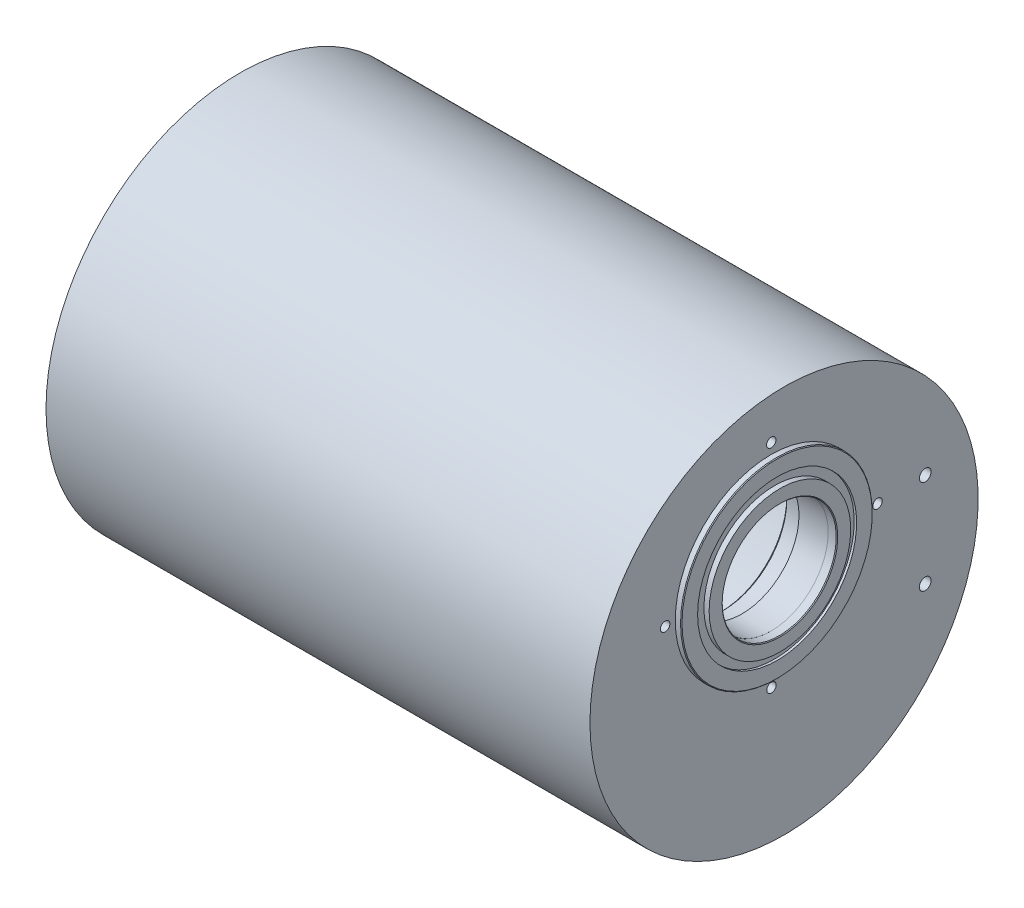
from build123d import *

# Parameters (mm, degrees)
SKETCH2_R               = 30.7975
SMALL_WINDOW_BORE_DEPTH = 15.875
SKETCH3_R               = 34.29
WINDOW_LARGE_BORE_DEPTH = 315.801696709
FILLET1_R               = 1.5875
CHAMFER1_SIZE           = 1.5875
FILLET4_R               = 1.016
SKETCH8_R               = 2.54
CUT_EXTRUDE1_DEPTH      = 9.525
CIRPATTERN1_COUNT       = 4
SKETCH9_R               = 3.175
CUT_EXTRUDE2_DEPTH      = 12.7


with BuildPart() as part:
    # Sketch1 → case 2 (revolve)
    with BuildSketch(Plane.XY, mode=Mode.PRIVATE) as case_2_sk:
        Polygon((-192.024, 104.775), (-192.024, 94.4372), (-172.974, 94.4372), (-172.974, 92.71), (74.0156, 92.71), (74.0156, 0), (101.6, 0), (101.6, 104.775), align=None)
    revolve(case_2_sk.sketch.rotate(Axis((-141.36726094, 0, 0), (1, 0, 0)), 90), axis=Axis((-141.36726094, 0, 0), (1, 0, 0)))

    # Sketch2 → small window bore (cut)
    with BuildSketch(Plane(origin=(101.6, 0, 0), x_dir=(0, 0, -1), z_dir=(1, 0, 0))):
        with Locations((-6.858, 24.892)):
            Circle(SKETCH2_R)
    extrude(amount=-SMALL_WINDOW_BORE_DEPTH, mode=Mode.SUBTRACT)

    # Sketch3 → window large bore (cut, through all)
    with BuildSketch(Plane(origin=(85.725, 0, 0), x_dir=(0, 0, -1), z_dir=(1, 0, 0))):
        with Locations((-6.858, 24.892)):
            Circle(SKETCH3_R)
    extrude(amount=-WINDOW_LARGE_BORE_DEPTH, mode=Mode.SUBTRACT)

    # Sketch4 → Boss-Revolve1 (revolve)
    with BuildSketch(Plane.XY.offset(6.985), mode=Mode.PRIVATE) as boss_revolve1_sk:
        Polygon((101.6, 55.6895), (105.965625, 55.6895), (106.3625, 56.086375), (106.3625, 63.119), (103.5431, 63.119), (103.5431, 67.818), (104.8385, 67.818), (104.8385, 76.234925), (104.441625, 76.6318), (101.6, 76.6318), align=None)
    revolve(boss_revolve1_sk.sketch.rotate(Axis((101.6, 24.892, 6.985), (1, 0, 0)), 90), axis=Axis((101.6, 24.892, 6.985), (1, 0, 0)))

    # Fillet1
    fillet1_edges = [part.edges().sort_by_distance(p)[0] for p in [
        (85.725, 24.892, 41.148),
    ]]
    fillet(fillet1_edges, radius=FILLET1_R)

    # Chamfer1
    chamfer1_edges = [part.edges().sort_by_distance(p)[0] for p in [
        (74.0156, 24.892, 41.148),
    ]]
    chamfer(chamfer1_edges, length=CHAMFER1_SIZE)

    # Fillet4
    fillet4_edges = [part.edges().sort_by_distance(p)[0] for p in [
        (74.0156, 24.892, 42.7355),
        (74.0156, 0, -92.71),
    ]]
    fillet(fillet4_edges, radius=FILLET4_R)

    # Sketch8 → Cut-Extrude1 (cut)
    with BuildSketch(Plane(origin=(101.6, 0, 0), x_dir=(0, 0, -1), z_dir=(1, 0, 0))):
        with Locations((-6.919117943, 82.219767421)):
            Circle(SKETCH8_R)
    cut_extrude1 = extrude(amount=-CUT_EXTRUDE1_DEPTH, mode=Mode.SUBTRACT)

    # CirPattern1: Cut-Extrude1 ×4 about axis
    cirpattern1_axis = Axis((0, 24.892, 6.858), (-1, 0, 0))
    for i in range(1, CIRPATTERN1_COUNT):
        add(cut_extrude1.rotate(cirpattern1_axis, i * 360 / CIRPATTERN1_COUNT), mode=Mode.SUBTRACT)

    # Sketch9 → Cut-Extrude2 (cut)
    with BuildSketch(Plane(origin=(101.6, 0, 0), x_dir=(0, 0, -1), z_dir=(1, 0, 0))):
        with Locations((76.2, -25.4)):
            Circle(SKETCH9_R)
        with Locations((76.2, 25.4)):
            Circle(SKETCH9_R)
    extrude(amount=-CUT_EXTRUDE2_DEPTH, mode=Mode.SUBTRACT)


solid = part.part
